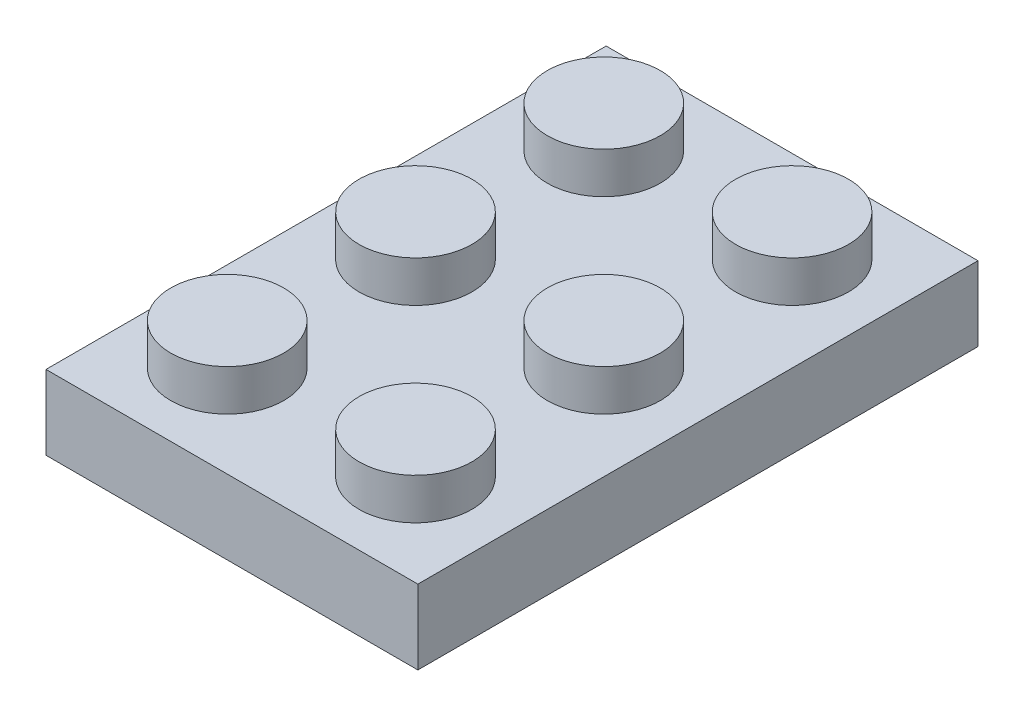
ISO-10303-21;
HEADER;
FILE_DESCRIPTION(('STEP AP214'),'2;1');
FILE_NAME('part.step','',(''),(''),'','','');
FILE_SCHEMA(('AUTOMOTIVE_DESIGN { 1 0 10303 214 1 1 1 1 }'));
ENDSEC;
DATA;
#1=APPLICATION_CONTEXT('core data for automotive mechanical design processes');
#2=APPLICATION_PROTOCOL_DEFINITION('international standard','automotive_design',2000,#1);
#3=PRODUCT_CONTEXT('',#1,'mechanical');
#4=PRODUCT('Part','Part','',(#3));
#5=PRODUCT_RELATED_PRODUCT_CATEGORY('part','',(#4));
#6=PRODUCT_DEFINITION_FORMATION('','',#4);
#7=PRODUCT_DEFINITION_CONTEXT('part definition',#1,'design');
#8=PRODUCT_DEFINITION('design','',#6,#7);
#9=PRODUCT_DEFINITION_SHAPE('','',#8);
#10=(LENGTH_UNIT() NAMED_UNIT(*) SI_UNIT(.MILLI.,.METRE.));
#11=(NAMED_UNIT(*) PLANE_ANGLE_UNIT() SI_UNIT($,.RADIAN.));
#12=(NAMED_UNIT(*) SI_UNIT($,.STERADIAN.) SOLID_ANGLE_UNIT());
#13=UNCERTAINTY_MEASURE_WITH_UNIT(LENGTH_MEASURE(1.E-05),#10,'distance_accuracy_value','');
#14=(GEOMETRIC_REPRESENTATION_CONTEXT(3) GLOBAL_UNCERTAINTY_ASSIGNED_CONTEXT((#13)) GLOBAL_UNIT_ASSIGNED_CONTEXT((#10,
#11,#12)) REPRESENTATION_CONTEXT('',''));
#15=CARTESIAN_POINT('',(0.,0.,0.));
#16=DIRECTION('',(0.,0.,1.));
#17=DIRECTION('',(1.,0.,0.));
#18=AXIS2_PLACEMENT_3D('',#15,#16,#17);
#19=CARTESIAN_POINT('',(0.,3.16,-23.8));
#20=DIRECTION('',(0.,1.,0.));
#21=DIRECTION('',(0.,0.,1.));
#22=AXIS2_PLACEMENT_3D('',#19,#20,#21);
#23=PLANE('',#22);
#24=CARTESIAN_POINT('',(-12.,3.16,-19.9));
#25=DIRECTION('',(0.,1.,0.));
#26=DIRECTION('',(0.,0.,1.));
#27=AXIS2_PLACEMENT_3D('',#24,#25,#26);
#28=CIRCLE('',#27,2.4);
#29=CARTESIAN_POINT('',(-12.,3.16,-17.5));
#30=VERTEX_POINT('',#29);
#31=EDGE_CURVE('E319',#30,#30,#28,.T.);
#32=ORIENTED_EDGE('',*,*,#31,.F.);
#33=EDGE_LOOP('',(#32));
#34=FACE_BOUND('',#33,.T.);
#35=CARTESIAN_POINT('',(-4.,3.16,-3.9));
#36=DIRECTION('',(0.,1.,0.));
#37=DIRECTION('',(0.,0.,1.));
#38=AXIS2_PLACEMENT_3D('',#35,#36,#37);
#39=CIRCLE('',#38,2.4);
#40=CARTESIAN_POINT('',(-4.,3.16,-1.5));
#41=VERTEX_POINT('',#40);
#42=EDGE_CURVE('E151',#41,#41,#39,.T.);
#43=ORIENTED_EDGE('',*,*,#42,.F.);
#44=EDGE_LOOP('',(#43));
#45=FACE_BOUND('',#44,.T.);
#46=CARTESIAN_POINT('',(-4.,3.16,-19.9));
#47=DIRECTION('',(0.,1.,0.));
#48=DIRECTION('',(0.,0.,1.));
#49=AXIS2_PLACEMENT_3D('',#46,#47,#48);
#50=CIRCLE('',#49,2.4);
#51=CARTESIAN_POINT('',(-4.,3.16,-17.5));
#52=VERTEX_POINT('',#51);
#53=EDGE_CURVE('E164',#52,#52,#50,.T.);
#54=ORIENTED_EDGE('',*,*,#53,.F.);
#55=EDGE_LOOP('',(#54));
#56=FACE_BOUND('',#55,.T.);
#57=DIRECTION('',(0.,0.,-1.));
#58=VECTOR('',#57,1.);
#59=CARTESIAN_POINT('',(0.,3.16,0.));
#60=LINE('',#59,#58);
#61=CARTESIAN_POINT('',(0.,3.16,0.));
#62=VERTEX_POINT('',#61);
#63=CARTESIAN_POINT('',(0.,3.16,-23.8));
#64=VERTEX_POINT('',#63);
#65=EDGE_CURVE('E173',#62,#64,#60,.T.);
#66=ORIENTED_EDGE('',*,*,#65,.T.);
#67=DIRECTION('',(-1.,0.,0.));
#68=VECTOR('',#67,1.);
#69=CARTESIAN_POINT('',(0.,3.16,-23.8));
#70=LINE('',#69,#68);
#71=CARTESIAN_POINT('',(-15.8,3.16,-23.8));
#72=VERTEX_POINT('',#71);
#73=EDGE_CURVE('E89',#64,#72,#70,.T.);
#74=ORIENTED_EDGE('',*,*,#73,.T.);
#75=DIRECTION('',(0.,0.,1.));
#76=VECTOR('',#75,1.);
#77=CARTESIAN_POINT('',(-15.8,3.16,0.));
#78=LINE('',#77,#76);
#79=CARTESIAN_POINT('',(-15.8,3.16,0.));
#80=VERTEX_POINT('',#79);
#81=EDGE_CURVE('E176',#72,#80,#78,.T.);
#82=ORIENTED_EDGE('',*,*,#81,.T.);
#83=DIRECTION('',(1.,0.,0.));
#84=VECTOR('',#83,1.);
#85=CARTESIAN_POINT('',(0.,3.16,0.));
#86=LINE('',#85,#84);
#87=EDGE_CURVE('E61',#80,#62,#86,.T.);
#88=ORIENTED_EDGE('',*,*,#87,.T.);
#89=EDGE_LOOP('',(#66,#74,#82,#88));
#90=FACE_BOUND('',#89,.T.);
#91=CARTESIAN_POINT('',(-4.,3.16,-11.9));
#92=DIRECTION('',(0.,1.,0.));
#93=DIRECTION('',(0.,0.,1.));
#94=AXIS2_PLACEMENT_3D('',#91,#92,#93);
#95=CIRCLE('',#94,2.4);
#96=CARTESIAN_POINT('',(-4.,3.16,-9.5));
#97=VERTEX_POINT('',#96);
#98=EDGE_CURVE('E158',#97,#97,#95,.T.);
#99=ORIENTED_EDGE('',*,*,#98,.F.);
#100=EDGE_LOOP('',(#99));
#101=FACE_BOUND('',#100,.T.);
#102=CARTESIAN_POINT('',(-12.,3.16,-3.9));
#103=DIRECTION('',(0.,1.,0.));
#104=DIRECTION('',(0.,0.,1.));
#105=AXIS2_PLACEMENT_3D('',#102,#103,#104);
#106=CIRCLE('',#105,2.4);
#107=CARTESIAN_POINT('',(-12.,3.16,-1.5));
#108=VERTEX_POINT('',#107);
#109=EDGE_CURVE('E330',#108,#108,#106,.T.);
#110=ORIENTED_EDGE('',*,*,#109,.F.);
#111=EDGE_LOOP('',(#110));
#112=FACE_BOUND('',#111,.T.);
#113=CARTESIAN_POINT('',(-12.,3.16,-11.9));
#114=DIRECTION('',(0.,1.,0.));
#115=DIRECTION('',(0.,0.,1.));
#116=AXIS2_PLACEMENT_3D('',#113,#114,#115);
#117=CIRCLE('',#116,2.4);
#118=CARTESIAN_POINT('',(-12.,3.16,-9.5));
#119=VERTEX_POINT('',#118);
#120=EDGE_CURVE('E320',#119,#119,#117,.T.);
#121=ORIENTED_EDGE('',*,*,#120,.F.);
#122=EDGE_LOOP('',(#121));
#123=FACE_BOUND('',#122,.T.);
#124=ADVANCED_FACE('F37',(#34,#45,#56,#90,#101,#112,#123),#23,.T.);
#125=CARTESIAN_POINT('',(-14.05,2.5,-22.05));
#126=DIRECTION('',(0.,-1.,0.));
#127=DIRECTION('',(0.,0.,-1.));
#128=AXIS2_PLACEMENT_3D('',#125,#126,#127);
#129=PLANE('',#128);
#130=CARTESIAN_POINT('',(-8.0492206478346,2.5,-8.));
#131=DIRECTION('',(0.,-1.,0.));
#132=DIRECTION('',(0.,0.,-1.));
#133=AXIS2_PLACEMENT_3D('',#130,#131,#132);
#134=CIRCLE('',#133,3.4);
#135=CARTESIAN_POINT('',(-8.0492206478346,2.5,-11.4));
#136=VERTEX_POINT('',#135);
#137=EDGE_CURVE('E138',#136,#136,#134,.T.);
#138=ORIENTED_EDGE('',*,*,#137,.F.);
#139=EDGE_LOOP('',(#138));
#140=FACE_BOUND('',#139,.T.);
#141=DIRECTION('',(0.,0.,-1.));
#142=VECTOR('',#141,1.);
#143=CARTESIAN_POINT('',(-14.05,2.5,-1.75));
#144=LINE('',#143,#142);
#145=CARTESIAN_POINT('',(-14.05,2.5,-1.75));
#146=VERTEX_POINT('',#145);
#147=CARTESIAN_POINT('',(-14.05,2.5,-22.05));
#148=VERTEX_POINT('',#147);
#149=EDGE_CURVE('E113',#146,#148,#144,.T.);
#150=ORIENTED_EDGE('',*,*,#149,.T.);
#151=DIRECTION('',(1.,0.,0.));
#152=VECTOR('',#151,1.);
#153=CARTESIAN_POINT('',(-14.05,2.5,-22.05));
#154=LINE('',#153,#152);
#155=CARTESIAN_POINT('',(-1.75,2.5,-22.05));
#156=VERTEX_POINT('',#155);
#157=EDGE_CURVE('E122',#148,#156,#154,.T.);
#158=ORIENTED_EDGE('',*,*,#157,.T.);
#159=DIRECTION('',(0.,0.,1.));
#160=VECTOR('',#159,1.);
#161=CARTESIAN_POINT('',(-1.75,2.5,-1.75));
#162=LINE('',#161,#160);
#163=CARTESIAN_POINT('',(-1.75,2.5,-1.75));
#164=VERTEX_POINT('',#163);
#165=EDGE_CURVE('E127',#156,#164,#162,.T.);
#166=ORIENTED_EDGE('',*,*,#165,.T.);
#167=DIRECTION('',(-1.,0.,0.));
#168=VECTOR('',#167,1.);
#169=CARTESIAN_POINT('',(-14.05,2.5,-1.75));
#170=LINE('',#169,#168);
#171=EDGE_CURVE('E119',#164,#146,#170,.T.);
#172=ORIENTED_EDGE('',*,*,#171,.T.);
#173=EDGE_LOOP('',(#150,#158,#166,#172));
#174=FACE_BOUND('',#173,.T.);
#175=CARTESIAN_POINT('',(-8.0492206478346,2.5,-16.));
#176=DIRECTION('',(0.,-1.,0.));
#177=DIRECTION('',(0.,0.,-1.));
#178=AXIS2_PLACEMENT_3D('',#175,#176,#177);
#179=CIRCLE('',#178,3.4);
#180=CARTESIAN_POINT('',(-8.0492206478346,2.5,-19.4));
#181=VERTEX_POINT('',#180);
#182=EDGE_CURVE('E346',#181,#181,#179,.T.);
#183=ORIENTED_EDGE('',*,*,#182,.F.);
#184=EDGE_LOOP('',(#183));
#185=FACE_BOUND('',#184,.T.);
#186=ADVANCED_FACE('F129',(#140,#174,#185),#129,.T.);
#187=CARTESIAN_POINT('',(0.,3.16,0.));
#188=DIRECTION('',(-1.,0.,0.));
#189=DIRECTION('',(0.,0.,1.));
#190=AXIS2_PLACEMENT_3D('',#187,#188,#189);
#191=PLANE('',#190);
#192=DIRECTION('',(0.,0.,-1.));
#193=VECTOR('',#192,1.);
#194=CARTESIAN_POINT('',(0.,0.,0.));
#195=LINE('',#194,#193);
#196=CARTESIAN_POINT('',(0.,0.,0.));
#197=VERTEX_POINT('',#196);
#198=CARTESIAN_POINT('',(0.,0.,-23.8));
#199=VERTEX_POINT('',#198);
#200=EDGE_CURVE('E170',#197,#199,#195,.T.);
#201=ORIENTED_EDGE('',*,*,#200,.T.);
#202=DIRECTION('',(0.,-1.,0.));
#203=VECTOR('',#202,1.);
#204=CARTESIAN_POINT('',(0.,3.16,-23.8));
#205=LINE('',#204,#203);
#206=EDGE_CURVE('E11',#64,#199,#205,.T.);
#207=ORIENTED_EDGE('',*,*,#206,.F.);
#208=ORIENTED_EDGE('',*,*,#65,.F.);
#209=DIRECTION('',(0.,-1.,0.));
#210=VECTOR('',#209,1.);
#211=CARTESIAN_POINT('',(0.,3.16,0.));
#212=LINE('',#211,#210);
#213=EDGE_CURVE('E179',#62,#197,#212,.T.);
#214=ORIENTED_EDGE('',*,*,#213,.T.);
#215=EDGE_LOOP('',(#201,#207,#208,#214));
#216=FACE_BOUND('',#215,.T.);
#217=ADVANCED_FACE('F39',(#216),#191,.F.);
#218=CARTESIAN_POINT('',(0.,3.16,-23.8));
#219=DIRECTION('',(0.,0.,1.));
#220=DIRECTION('',(1.,0.,0.));
#221=AXIS2_PLACEMENT_3D('',#218,#219,#220);
#222=PLANE('',#221);
#223=DIRECTION('',(-1.,0.,0.));
#224=VECTOR('',#223,1.);
#225=CARTESIAN_POINT('',(0.,0.,-23.8));
#226=LINE('',#225,#224);
#227=CARTESIAN_POINT('',(-15.8,0.,-23.8));
#228=VERTEX_POINT('',#227);
#229=EDGE_CURVE('E182',#199,#228,#226,.T.);
#230=ORIENTED_EDGE('',*,*,#229,.T.);
#231=DIRECTION('',(0.,-1.,0.));
#232=VECTOR('',#231,1.);
#233=CARTESIAN_POINT('',(-15.8,3.16,-23.8));
#234=LINE('',#233,#232);
#235=EDGE_CURVE('E45',#72,#228,#234,.T.);
#236=ORIENTED_EDGE('',*,*,#235,.F.);
#237=ORIENTED_EDGE('',*,*,#73,.F.);
#238=ORIENTED_EDGE('',*,*,#206,.T.);
#239=EDGE_LOOP('',(#230,#236,#237,#238));
#240=FACE_BOUND('',#239,.T.);
#241=ADVANCED_FACE('F211',(#240),#222,.F.);
#242=CARTESIAN_POINT('',(-15.8,3.16,0.));
#243=DIRECTION('',(1.,0.,0.));
#244=DIRECTION('',(0.,0.,-1.));
#245=AXIS2_PLACEMENT_3D('',#242,#243,#244);
#246=PLANE('',#245);
#247=DIRECTION('',(0.,0.,1.));
#248=VECTOR('',#247,1.);
#249=CARTESIAN_POINT('',(-15.8,0.,0.));
#250=LINE('',#249,#248);
#251=CARTESIAN_POINT('',(-15.8,0.,0.));
#252=VERTEX_POINT('',#251);
#253=EDGE_CURVE('E184',#228,#252,#250,.T.);
#254=ORIENTED_EDGE('',*,*,#253,.T.);
#255=DIRECTION('',(0.,-1.,0.));
#256=VECTOR('',#255,1.);
#257=CARTESIAN_POINT('',(-15.8,3.16,0.));
#258=LINE('',#257,#256);
#259=EDGE_CURVE('E188',#80,#252,#258,.T.);
#260=ORIENTED_EDGE('',*,*,#259,.F.);
#261=ORIENTED_EDGE('',*,*,#81,.F.);
#262=ORIENTED_EDGE('',*,*,#235,.T.);
#263=EDGE_LOOP('',(#254,#260,#261,#262));
#264=FACE_BOUND('',#263,.T.);
#265=ADVANCED_FACE('F193',(#264),#246,.F.);
#266=CARTESIAN_POINT('',(0.,3.16,0.));
#267=DIRECTION('',(0.,0.,-1.));
#268=DIRECTION('',(-1.,0.,0.));
#269=AXIS2_PLACEMENT_3D('',#266,#267,#268);
#270=PLANE('',#269);
#271=DIRECTION('',(1.,0.,0.));
#272=VECTOR('',#271,1.);
#273=CARTESIAN_POINT('',(0.,0.,0.));
#274=LINE('',#273,#272);
#275=EDGE_CURVE('E82',#252,#197,#274,.T.);
#276=ORIENTED_EDGE('',*,*,#275,.T.);
#277=ORIENTED_EDGE('',*,*,#213,.F.);
#278=ORIENTED_EDGE('',*,*,#87,.F.);
#279=ORIENTED_EDGE('',*,*,#259,.T.);
#280=EDGE_LOOP('',(#276,#277,#278,#279));
#281=FACE_BOUND('',#280,.T.);
#282=ADVANCED_FACE('F201',(#281),#270,.F.);
#283=CARTESIAN_POINT('',(0.,0.,-23.8));
#284=DIRECTION('',(0.,1.,0.));
#285=DIRECTION('',(0.,0.,1.));
#286=AXIS2_PLACEMENT_3D('',#283,#284,#285);
#287=PLANE('',#286);
#288=DIRECTION('',(1.,0.,0.));
#289=VECTOR('',#288,1.);
#290=CARTESIAN_POINT('',(-14.05,0.,-22.05));
#291=LINE('',#290,#289);
#292=CARTESIAN_POINT('',(-14.05,0.,-22.05));
#293=VERTEX_POINT('',#292);
#294=CARTESIAN_POINT('',(-1.75,0.,-22.05));
#295=VERTEX_POINT('',#294);
#296=EDGE_CURVE('E144',#293,#295,#291,.T.);
#297=ORIENTED_EDGE('',*,*,#296,.F.);
#298=DIRECTION('',(0.,0.,-1.));
#299=VECTOR('',#298,1.);
#300=CARTESIAN_POINT('',(-14.05,0.,-1.75));
#301=LINE('',#300,#299);
#302=CARTESIAN_POINT('',(-14.05,0.,-1.75));
#303=VERTEX_POINT('',#302);
#304=EDGE_CURVE('E52',#303,#293,#301,.T.);
#305=ORIENTED_EDGE('',*,*,#304,.F.);
#306=DIRECTION('',(-1.,0.,0.));
#307=VECTOR('',#306,1.);
#308=CARTESIAN_POINT('',(-14.05,0.,-1.75));
#309=LINE('',#308,#307);
#310=CARTESIAN_POINT('',(-1.75,0.,-1.75));
#311=VERTEX_POINT('',#310);
#312=EDGE_CURVE('E132',#311,#303,#309,.T.);
#313=ORIENTED_EDGE('',*,*,#312,.F.);
#314=DIRECTION('',(0.,0.,1.));
#315=VECTOR('',#314,1.);
#316=CARTESIAN_POINT('',(-1.75,0.,-1.75));
#317=LINE('',#316,#315);
#318=EDGE_CURVE('E135',#295,#311,#317,.T.);
#319=ORIENTED_EDGE('',*,*,#318,.F.);
#320=EDGE_LOOP('',(#297,#305,#313,#319));
#321=FACE_BOUND('',#320,.T.);
#322=ORIENTED_EDGE('',*,*,#200,.F.);
#323=ORIENTED_EDGE('',*,*,#275,.F.);
#324=ORIENTED_EDGE('',*,*,#253,.F.);
#325=ORIENTED_EDGE('',*,*,#229,.F.);
#326=EDGE_LOOP('',(#322,#323,#324,#325));
#327=FACE_BOUND('',#326,.T.);
#328=ADVANCED_FACE('F197',(#321,#327),#287,.F.);
#329=CARTESIAN_POINT('',(-4.,4.91,-19.9));
#330=DIRECTION('',(0.,-1.,0.));
#331=DIRECTION('',(0.,0.,-1.));
#332=AXIS2_PLACEMENT_3D('',#329,#330,#331);
#333=CYLINDRICAL_SURFACE('',#332,2.4);
#334=CARTESIAN_POINT('',(-4.,4.91,-19.9));
#335=DIRECTION('',(0.,1.,0.));
#336=DIRECTION('',(0.,0.,1.));
#337=AXIS2_PLACEMENT_3D('',#334,#335,#336);
#338=CIRCLE('',#337,2.4);
#339=CARTESIAN_POINT('',(-4.,4.91,-17.5));
#340=VERTEX_POINT('',#339);
#341=EDGE_CURVE('E167',#340,#340,#338,.T.);
#342=ORIENTED_EDGE('',*,*,#341,.F.);
#343=EDGE_LOOP('',(#342));
#344=FACE_BOUND('',#343,.T.);
#345=ORIENTED_EDGE('',*,*,#53,.T.);
#346=EDGE_LOOP('',(#345));
#347=FACE_BOUND('',#346,.T.);
#348=ADVANCED_FACE('F208',(#344,#347),#333,.T.);
#349=CARTESIAN_POINT('',(-4.,4.91,-19.9));
#350=DIRECTION('',(0.,1.,0.));
#351=DIRECTION('',(0.,0.,1.));
#352=AXIS2_PLACEMENT_3D('',#349,#350,#351);
#353=PLANE('',#352);
#354=ORIENTED_EDGE('',*,*,#341,.T.);
#355=EDGE_LOOP('',(#354));
#356=FACE_BOUND('',#355,.T.);
#357=ADVANCED_FACE('F226',(#356),#353,.T.);
#358=CARTESIAN_POINT('',(-4.,4.91,-11.9));
#359=DIRECTION('',(0.,-1.,0.));
#360=DIRECTION('',(0.,0.,-1.));
#361=AXIS2_PLACEMENT_3D('',#358,#359,#360);
#362=CYLINDRICAL_SURFACE('',#361,2.4);
#363=CARTESIAN_POINT('',(-4.,4.91,-11.9));
#364=DIRECTION('',(0.,1.,0.));
#365=DIRECTION('',(0.,0.,1.));
#366=AXIS2_PLACEMENT_3D('',#363,#364,#365);
#367=CIRCLE('',#366,2.4);
#368=CARTESIAN_POINT('',(-4.,4.91,-9.5));
#369=VERTEX_POINT('',#368);
#370=EDGE_CURVE('E161',#369,#369,#367,.T.);
#371=ORIENTED_EDGE('',*,*,#370,.F.);
#372=EDGE_LOOP('',(#371));
#373=FACE_BOUND('',#372,.T.);
#374=ORIENTED_EDGE('',*,*,#98,.T.);
#375=EDGE_LOOP('',(#374));
#376=FACE_BOUND('',#375,.T.);
#377=ADVANCED_FACE('F230',(#373,#376),#362,.T.);
#378=CARTESIAN_POINT('',(-4.,4.91,-11.9));
#379=DIRECTION('',(0.,1.,0.));
#380=DIRECTION('',(0.,0.,1.));
#381=AXIS2_PLACEMENT_3D('',#378,#379,#380);
#382=PLANE('',#381);
#383=ORIENTED_EDGE('',*,*,#370,.T.);
#384=EDGE_LOOP('',(#383));
#385=FACE_BOUND('',#384,.T.);
#386=ADVANCED_FACE('F234',(#385),#382,.T.);
#387=CARTESIAN_POINT('',(-4.,4.91,-3.9));
#388=DIRECTION('',(0.,-1.,0.));
#389=DIRECTION('',(0.,0.,-1.));
#390=AXIS2_PLACEMENT_3D('',#387,#388,#389);
#391=CYLINDRICAL_SURFACE('',#390,2.4);
#392=CARTESIAN_POINT('',(-4.,4.91,-3.9));
#393=DIRECTION('',(0.,1.,0.));
#394=DIRECTION('',(0.,0.,1.));
#395=AXIS2_PLACEMENT_3D('',#392,#393,#394);
#396=CIRCLE('',#395,2.4);
#397=CARTESIAN_POINT('',(-4.,4.91,-1.5));
#398=VERTEX_POINT('',#397);
#399=EDGE_CURVE('E155',#398,#398,#396,.T.);
#400=ORIENTED_EDGE('',*,*,#399,.F.);
#401=EDGE_LOOP('',(#400));
#402=FACE_BOUND('',#401,.T.);
#403=ORIENTED_EDGE('',*,*,#42,.T.);
#404=EDGE_LOOP('',(#403));
#405=FACE_BOUND('',#404,.T.);
#406=ADVANCED_FACE('F238',(#402,#405),#391,.T.);
#407=CARTESIAN_POINT('',(-4.,4.91,-3.9));
#408=DIRECTION('',(0.,1.,0.));
#409=DIRECTION('',(0.,0.,1.));
#410=AXIS2_PLACEMENT_3D('',#407,#408,#409);
#411=PLANE('',#410);
#412=ORIENTED_EDGE('',*,*,#399,.T.);
#413=EDGE_LOOP('',(#412));
#414=FACE_BOUND('',#413,.T.);
#415=ADVANCED_FACE('F242',(#414),#411,.T.);
#416=CARTESIAN_POINT('',(-14.05,2.5,-1.75));
#417=DIRECTION('',(-1.,0.,0.));
#418=DIRECTION('',(0.,0.,1.));
#419=AXIS2_PLACEMENT_3D('',#416,#417,#418);
#420=PLANE('',#419);
#421=ORIENTED_EDGE('',*,*,#304,.T.);
#422=DIRECTION('',(0.,-1.,0.));
#423=VECTOR('',#422,1.);
#424=CARTESIAN_POINT('',(-14.05,2.5,-22.05));
#425=LINE('',#424,#423);
#426=EDGE_CURVE('E109',#148,#293,#425,.T.);
#427=ORIENTED_EDGE('',*,*,#426,.F.);
#428=ORIENTED_EDGE('',*,*,#149,.F.);
#429=DIRECTION('',(0.,-1.,0.));
#430=VECTOR('',#429,1.);
#431=CARTESIAN_POINT('',(-14.05,2.5,-1.75));
#432=LINE('',#431,#430);
#433=EDGE_CURVE('E149',#146,#303,#432,.T.);
#434=ORIENTED_EDGE('',*,*,#433,.T.);
#435=EDGE_LOOP('',(#421,#427,#428,#434));
#436=FACE_BOUND('',#435,.T.);
#437=ADVANCED_FACE('F111',(#436),#420,.F.);
#438=CARTESIAN_POINT('',(-14.05,2.5,-1.75));
#439=DIRECTION('',(0.,0.,1.));
#440=DIRECTION('',(1.,0.,0.));
#441=AXIS2_PLACEMENT_3D('',#438,#439,#440);
#442=PLANE('',#441);
#443=ORIENTED_EDGE('',*,*,#312,.T.);
#444=ORIENTED_EDGE('',*,*,#433,.F.);
#445=ORIENTED_EDGE('',*,*,#171,.F.);
#446=DIRECTION('',(0.,-1.,0.));
#447=VECTOR('',#446,1.);
#448=CARTESIAN_POINT('',(-1.75,2.5,-1.75));
#449=LINE('',#448,#447);
#450=EDGE_CURVE('E152',#164,#311,#449,.T.);
#451=ORIENTED_EDGE('',*,*,#450,.T.);
#452=EDGE_LOOP('',(#443,#444,#445,#451));
#453=FACE_BOUND('',#452,.T.);
#454=ADVANCED_FACE('F249',(#453),#442,.F.);
#455=CARTESIAN_POINT('',(-1.75,2.5,-1.75));
#456=DIRECTION('',(1.,0.,0.));
#457=DIRECTION('',(0.,0.,-1.));
#458=AXIS2_PLACEMENT_3D('',#455,#456,#457);
#459=PLANE('',#458);
#460=ORIENTED_EDGE('',*,*,#318,.T.);
#461=ORIENTED_EDGE('',*,*,#450,.F.);
#462=ORIENTED_EDGE('',*,*,#165,.F.);
#463=DIRECTION('',(0.,-1.,0.));
#464=VECTOR('',#463,1.);
#465=CARTESIAN_POINT('',(-1.75,2.5,-22.05));
#466=LINE('',#465,#464);
#467=EDGE_CURVE('E118',#156,#295,#466,.T.);
#468=ORIENTED_EDGE('',*,*,#467,.T.);
#469=EDGE_LOOP('',(#460,#461,#462,#468));
#470=FACE_BOUND('',#469,.T.);
#471=ADVANCED_FACE('F253',(#470),#459,.F.);
#472=CARTESIAN_POINT('',(-14.05,2.5,-22.05));
#473=DIRECTION('',(0.,0.,-1.));
#474=DIRECTION('',(-1.,0.,0.));
#475=AXIS2_PLACEMENT_3D('',#472,#473,#474);
#476=PLANE('',#475);
#477=ORIENTED_EDGE('',*,*,#296,.T.);
#478=ORIENTED_EDGE('',*,*,#467,.F.);
#479=ORIENTED_EDGE('',*,*,#157,.F.);
#480=ORIENTED_EDGE('',*,*,#426,.T.);
#481=EDGE_LOOP('',(#477,#478,#479,#480));
#482=FACE_BOUND('',#481,.T.);
#483=ADVANCED_FACE('F123',(#482),#476,.F.);
#484=CARTESIAN_POINT('',(-8.0492206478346,0.,-8.));
#485=DIRECTION('',(0.,1.,0.));
#486=DIRECTION('',(0.,0.,1.));
#487=AXIS2_PLACEMENT_3D('',#484,#485,#486);
#488=CYLINDRICAL_SURFACE('',#487,3.4);
#489=CARTESIAN_POINT('',(-8.0492206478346,0.,-8.));
#490=DIRECTION('',(0.,-1.,0.));
#491=DIRECTION('',(0.,0.,-1.));
#492=AXIS2_PLACEMENT_3D('',#489,#490,#491);
#493=CIRCLE('',#492,3.4);
#494=CARTESIAN_POINT('',(-8.0492206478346,0.,-11.4));
#495=VERTEX_POINT('',#494);
#496=EDGE_CURVE('E145',#495,#495,#493,.T.);
#497=ORIENTED_EDGE('',*,*,#496,.F.);
#498=EDGE_LOOP('',(#497));
#499=FACE_BOUND('',#498,.T.);
#500=ORIENTED_EDGE('',*,*,#137,.T.);
#501=EDGE_LOOP('',(#500));
#502=FACE_BOUND('',#501,.T.);
#503=ADVANCED_FACE('F252',(#499,#502),#488,.T.);
#504=CARTESIAN_POINT('',(-8.0492206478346,0.,-8.));
#505=DIRECTION('',(0.,-1.,0.));
#506=DIRECTION('',(0.,0.,-1.));
#507=AXIS2_PLACEMENT_3D('',#504,#505,#506);
#508=PLANE('',#507);
#509=CARTESIAN_POINT('',(-8.0492206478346,0.,-8.));
#510=DIRECTION('',(0.,-1.,0.));
#511=DIRECTION('',(0.,0.,-1.));
#512=AXIS2_PLACEMENT_3D('',#509,#510,#511);
#513=CIRCLE('',#512,2.4);
#514=CARTESIAN_POINT('',(-8.0492206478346,0.,-10.4));
#515=VERTEX_POINT('',#514);
#516=EDGE_CURVE('E340',#515,#515,#513,.T.);
#517=ORIENTED_EDGE('',*,*,#516,.F.);
#518=EDGE_LOOP('',(#517));
#519=FACE_BOUND('',#518,.T.);
#520=ORIENTED_EDGE('',*,*,#496,.T.);
#521=EDGE_LOOP('',(#520));
#522=FACE_BOUND('',#521,.T.);
#523=ADVANCED_FACE('F262',(#519,#522),#508,.T.);
#524=CARTESIAN_POINT('',(-8.0492206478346,0.,-16.));
#525=DIRECTION('',(0.,1.,0.));
#526=DIRECTION('',(0.,0.,1.));
#527=AXIS2_PLACEMENT_3D('',#524,#525,#526);
#528=CYLINDRICAL_SURFACE('',#527,3.4);
#529=CARTESIAN_POINT('',(-8.0492206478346,0.,-16.));
#530=DIRECTION('',(0.,-1.,0.));
#531=DIRECTION('',(0.,0.,-1.));
#532=AXIS2_PLACEMENT_3D('',#529,#530,#531);
#533=CIRCLE('',#532,3.4);
#534=CARTESIAN_POINT('',(-8.0492206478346,0.,-19.4));
#535=VERTEX_POINT('',#534);
#536=EDGE_CURVE('E349',#535,#535,#533,.T.);
#537=ORIENTED_EDGE('',*,*,#536,.F.);
#538=EDGE_LOOP('',(#537));
#539=FACE_BOUND('',#538,.T.);
#540=ORIENTED_EDGE('',*,*,#182,.T.);
#541=EDGE_LOOP('',(#540));
#542=FACE_BOUND('',#541,.T.);
#543=ADVANCED_FACE('F266',(#539,#542),#528,.T.);
#544=CARTESIAN_POINT('',(-8.0492206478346,0.,-16.));
#545=DIRECTION('',(0.,-1.,0.));
#546=DIRECTION('',(0.,0.,-1.));
#547=AXIS2_PLACEMENT_3D('',#544,#545,#546);
#548=PLANE('',#547);
#549=CARTESIAN_POINT('',(-8.0492206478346,0.,-16.));
#550=DIRECTION('',(0.,-1.,0.));
#551=DIRECTION('',(0.,0.,-1.));
#552=AXIS2_PLACEMENT_3D('',#549,#550,#551);
#553=CIRCLE('',#552,2.4);
#554=CARTESIAN_POINT('',(-8.0492206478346,0.,-18.4));
#555=VERTEX_POINT('',#554);
#556=EDGE_CURVE('E336',#555,#555,#553,.T.);
#557=ORIENTED_EDGE('',*,*,#556,.F.);
#558=EDGE_LOOP('',(#557));
#559=FACE_BOUND('',#558,.T.);
#560=ORIENTED_EDGE('',*,*,#536,.T.);
#561=EDGE_LOOP('',(#560));
#562=FACE_BOUND('',#561,.T.);
#563=ADVANCED_FACE('F270',(#559,#562),#548,.T.);
#564=CARTESIAN_POINT('',(-8.0492206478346,2.5,-8.));
#565=DIRECTION('',(0.,-1.,0.));
#566=DIRECTION('',(0.,0.,-1.));
#567=AXIS2_PLACEMENT_3D('',#564,#565,#566);
#568=CYLINDRICAL_SURFACE('',#567,2.4);
#569=CARTESIAN_POINT('',(-8.0492206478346,2.5,-8.));
#570=DIRECTION('',(0.,-1.,0.));
#571=DIRECTION('',(0.,0.,-1.));
#572=AXIS2_PLACEMENT_3D('',#569,#570,#571);
#573=CIRCLE('',#572,2.4);
#574=CARTESIAN_POINT('',(-8.0492206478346,2.5,-10.4));
#575=VERTEX_POINT('',#574);
#576=EDGE_CURVE('E343',#575,#575,#573,.T.);
#577=ORIENTED_EDGE('',*,*,#576,.F.);
#578=EDGE_LOOP('',(#577));
#579=FACE_BOUND('',#578,.T.);
#580=ORIENTED_EDGE('',*,*,#516,.T.);
#581=EDGE_LOOP('',(#580));
#582=FACE_BOUND('',#581,.T.);
#583=ADVANCED_FACE('F274',(#579,#582),#568,.F.);
#584=CARTESIAN_POINT('',(-8.0492206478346,2.5,-8.));
#585=DIRECTION('',(0.,-1.,0.));
#586=DIRECTION('',(0.,0.,-1.));
#587=AXIS2_PLACEMENT_3D('',#584,#585,#586);
#588=PLANE('',#587);
#589=ORIENTED_EDGE('',*,*,#576,.T.);
#590=EDGE_LOOP('',(#589));
#591=FACE_BOUND('',#590,.T.);
#592=ADVANCED_FACE('F278',(#591),#588,.T.);
#593=CARTESIAN_POINT('',(-8.0492206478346,2.5,-16.));
#594=DIRECTION('',(0.,-1.,0.));
#595=DIRECTION('',(0.,0.,-1.));
#596=AXIS2_PLACEMENT_3D('',#593,#594,#595);
#597=CYLINDRICAL_SURFACE('',#596,2.4);
#598=CARTESIAN_POINT('',(-8.0492206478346,2.5,-16.));
#599=DIRECTION('',(0.,-1.,0.));
#600=DIRECTION('',(0.,0.,-1.));
#601=AXIS2_PLACEMENT_3D('',#598,#599,#600);
#602=CIRCLE('',#601,2.4);
#603=CARTESIAN_POINT('',(-8.0492206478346,2.5,-18.4));
#604=VERTEX_POINT('',#603);
#605=EDGE_CURVE('E337',#604,#604,#602,.T.);
#606=ORIENTED_EDGE('',*,*,#605,.F.);
#607=EDGE_LOOP('',(#606));
#608=FACE_BOUND('',#607,.T.);
#609=ORIENTED_EDGE('',*,*,#556,.T.);
#610=EDGE_LOOP('',(#609));
#611=FACE_BOUND('',#610,.T.);
#612=ADVANCED_FACE('F282',(#608,#611),#597,.F.);
#613=CARTESIAN_POINT('',(-8.0492206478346,2.5,-16.));
#614=DIRECTION('',(0.,-1.,0.));
#615=DIRECTION('',(0.,0.,-1.));
#616=AXIS2_PLACEMENT_3D('',#613,#614,#615);
#617=PLANE('',#616);
#618=ORIENTED_EDGE('',*,*,#605,.T.);
#619=EDGE_LOOP('',(#618));
#620=FACE_BOUND('',#619,.T.);
#621=ADVANCED_FACE('F286',(#620),#617,.T.);
#622=CARTESIAN_POINT('',(-12.,4.91,-3.9));
#623=DIRECTION('',(0.,-1.,0.));
#624=DIRECTION('',(0.,0.,-1.));
#625=AXIS2_PLACEMENT_3D('',#622,#623,#624);
#626=CYLINDRICAL_SURFACE('',#625,2.4);
#627=CARTESIAN_POINT('',(-12.,4.91,-3.9));
#628=DIRECTION('',(0.,1.,0.));
#629=DIRECTION('',(0.,0.,1.));
#630=AXIS2_PLACEMENT_3D('',#627,#628,#629);
#631=CIRCLE('',#630,2.4);
#632=CARTESIAN_POINT('',(-12.,4.91,-1.5));
#633=VERTEX_POINT('',#632);
#634=EDGE_CURVE('E333',#633,#633,#631,.T.);
#635=ORIENTED_EDGE('',*,*,#634,.F.);
#636=EDGE_LOOP('',(#635));
#637=FACE_BOUND('',#636,.T.);
#638=ORIENTED_EDGE('',*,*,#109,.T.);
#639=EDGE_LOOP('',(#638));
#640=FACE_BOUND('',#639,.T.);
#641=ADVANCED_FACE('F290',(#637,#640),#626,.T.);
#642=CARTESIAN_POINT('',(-12.,4.91,-3.9));
#643=DIRECTION('',(0.,1.,0.));
#644=DIRECTION('',(0.,0.,1.));
#645=AXIS2_PLACEMENT_3D('',#642,#643,#644);
#646=PLANE('',#645);
#647=ORIENTED_EDGE('',*,*,#634,.T.);
#648=EDGE_LOOP('',(#647));
#649=FACE_BOUND('',#648,.T.);
#650=ADVANCED_FACE('F292',(#649),#646,.T.);
#651=CARTESIAN_POINT('',(-12.,4.91,-19.9));
#652=DIRECTION('',(0.,-1.,0.));
#653=DIRECTION('',(0.,0.,-1.));
#654=AXIS2_PLACEMENT_3D('',#651,#652,#653);
#655=CYLINDRICAL_SURFACE('',#654,2.4);
#656=CARTESIAN_POINT('',(-12.,4.91,-19.9));
#657=DIRECTION('',(0.,1.,0.));
#658=DIRECTION('',(0.,0.,1.));
#659=AXIS2_PLACEMENT_3D('',#656,#657,#658);
#660=CIRCLE('',#659,2.4);
#661=CARTESIAN_POINT('',(-12.,4.91,-17.5));
#662=VERTEX_POINT('',#661);
#663=EDGE_CURVE('E323',#662,#662,#660,.T.);
#664=ORIENTED_EDGE('',*,*,#663,.F.);
#665=EDGE_LOOP('',(#664));
#666=FACE_BOUND('',#665,.T.);
#667=ORIENTED_EDGE('',*,*,#31,.T.);
#668=EDGE_LOOP('',(#667));
#669=FACE_BOUND('',#668,.T.);
#670=ADVANCED_FACE('F299',(#666,#669),#655,.T.);
#671=CARTESIAN_POINT('',(-12.,4.91,-19.9));
#672=DIRECTION('',(0.,1.,0.));
#673=DIRECTION('',(0.,0.,1.));
#674=AXIS2_PLACEMENT_3D('',#671,#672,#673);
#675=PLANE('',#674);
#676=ORIENTED_EDGE('',*,*,#663,.T.);
#677=EDGE_LOOP('',(#676));
#678=FACE_BOUND('',#677,.T.);
#679=ADVANCED_FACE('F296',(#678),#675,.T.);
#680=CARTESIAN_POINT('',(-12.,4.91,-11.9));
#681=DIRECTION('',(0.,-1.,0.));
#682=DIRECTION('',(0.,0.,-1.));
#683=AXIS2_PLACEMENT_3D('',#680,#681,#682);
#684=CYLINDRICAL_SURFACE('',#683,2.4);
#685=CARTESIAN_POINT('',(-12.,4.91,-11.9));
#686=DIRECTION('',(0.,1.,0.));
#687=DIRECTION('',(0.,0.,1.));
#688=AXIS2_PLACEMENT_3D('',#685,#686,#687);
#689=CIRCLE('',#688,2.4);
#690=CARTESIAN_POINT('',(-12.,4.91,-9.5));
#691=VERTEX_POINT('',#690);
#692=EDGE_CURVE('E318',#691,#691,#689,.T.);
#693=ORIENTED_EDGE('',*,*,#692,.F.);
#694=EDGE_LOOP('',(#693));
#695=FACE_BOUND('',#694,.T.);
#696=ORIENTED_EDGE('',*,*,#120,.T.);
#697=EDGE_LOOP('',(#696));
#698=FACE_BOUND('',#697,.T.);
#699=ADVANCED_FACE('F307',(#695,#698),#684,.T.);
#700=CARTESIAN_POINT('',(-12.,4.91,-11.9));
#701=DIRECTION('',(0.,1.,0.));
#702=DIRECTION('',(0.,0.,1.));
#703=AXIS2_PLACEMENT_3D('',#700,#701,#702);
#704=PLANE('',#703);
#705=ORIENTED_EDGE('',*,*,#692,.T.);
#706=EDGE_LOOP('',(#705));
#707=FACE_BOUND('',#706,.T.);
#708=ADVANCED_FACE('F304',(#707),#704,.T.);
#709=CLOSED_SHELL('',(#124,#186,#217,#241,#265,#282,#328,#348,#357,#377,#386,#406,#415,#437,
#454,#471,#483,#503,#523,#543,#563,#583,#592,#612,#621,#641,#650,#670,#679,#699,#708));
#710=MANIFOLD_SOLID_BREP('B2',#709);
#711=ADVANCED_BREP_SHAPE_REPRESENTATION('',(#18,#710),#14);
#712=SHAPE_DEFINITION_REPRESENTATION(#9,#711);
ENDSEC;
END-ISO-10303-21;
